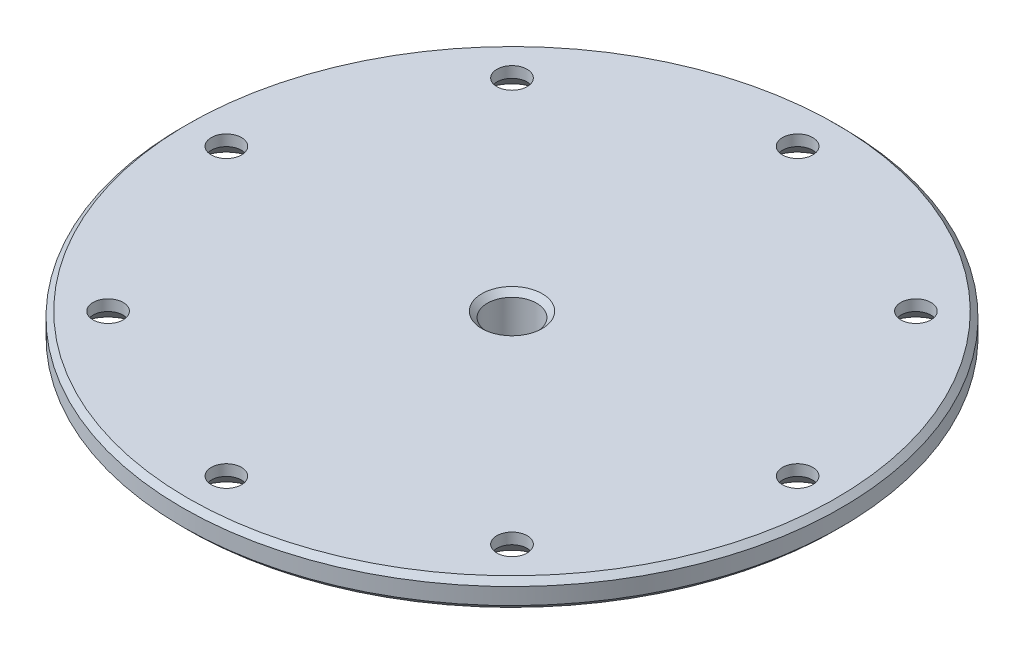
ISO-10303-21;
HEADER;
FILE_DESCRIPTION(('STEP AP214'),'2;1');
FILE_NAME('part.step','',(''),(''),'','','');
FILE_SCHEMA(('AUTOMOTIVE_DESIGN { 1 0 10303 214 1 1 1 1 }'));
ENDSEC;
DATA;
#1=APPLICATION_CONTEXT('core data for automotive mechanical design processes');
#2=APPLICATION_PROTOCOL_DEFINITION('international standard','automotive_design',2000,#1);
#3=PRODUCT_CONTEXT('',#1,'mechanical');
#4=PRODUCT('Part','Part','',(#3));
#5=PRODUCT_RELATED_PRODUCT_CATEGORY('part','',(#4));
#6=PRODUCT_DEFINITION_FORMATION('','',#4);
#7=PRODUCT_DEFINITION_CONTEXT('part definition',#1,'design');
#8=PRODUCT_DEFINITION('design','',#6,#7);
#9=PRODUCT_DEFINITION_SHAPE('','',#8);
#10=(LENGTH_UNIT() NAMED_UNIT(*) SI_UNIT(.MILLI.,.METRE.));
#11=(NAMED_UNIT(*) PLANE_ANGLE_UNIT() SI_UNIT($,.RADIAN.));
#12=(NAMED_UNIT(*) SI_UNIT($,.STERADIAN.) SOLID_ANGLE_UNIT());
#13=UNCERTAINTY_MEASURE_WITH_UNIT(LENGTH_MEASURE(1.E-05),#10,'distance_accuracy_value','');
#14=(GEOMETRIC_REPRESENTATION_CONTEXT(3) GLOBAL_UNCERTAINTY_ASSIGNED_CONTEXT((#13)) GLOBAL_UNIT_ASSIGNED_CONTEXT((#10,
#11,#12)) REPRESENTATION_CONTEXT('',''));
#15=CARTESIAN_POINT('',(0.,0.,0.));
#16=DIRECTION('',(0.,0.,1.));
#17=DIRECTION('',(1.,0.,0.));
#18=AXIS2_PLACEMENT_3D('',#15,#16,#17);
#19=CARTESIAN_POINT('',(0.,0.,0.));
#20=DIRECTION('',(0.,-1.,0.));
#21=DIRECTION('',(0.,0.,-1.));
#22=AXIS2_PLACEMENT_3D('',#19,#20,#21);
#23=PLANE('',#22);
#24=CARTESIAN_POINT('',(0.,0.,0.));
#25=DIRECTION('',(0.,-1.,0.));
#26=DIRECTION('',(0.,0.,-1.));
#27=AXIS2_PLACEMENT_3D('',#24,#25,#26);
#28=CIRCLE('',#27,5.49999999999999);
#29=CARTESIAN_POINT('',(0.,0.,-5.49999999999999));
#30=VERTEX_POINT('',#29);
#31=EDGE_CURVE('E35',#30,#30,#28,.F.);
#32=ORIENTED_EDGE('',*,*,#31,.T.);
#33=EDGE_LOOP('',(#32));
#34=FACE_BOUND('',#33,.T.);
#35=CARTESIAN_POINT('',(0.,0.,0.));
#36=DIRECTION('',(0.,-1.,0.));
#37=DIRECTION('',(0.,0.,-1.));
#38=AXIS2_PLACEMENT_3D('',#35,#36,#37);
#39=CIRCLE('',#38,14.);
#40=CARTESIAN_POINT('',(0.,0.,-14.));
#41=VERTEX_POINT('',#40);
#42=EDGE_CURVE('E117',#41,#41,#39,.T.);
#43=ORIENTED_EDGE('',*,*,#42,.T.);
#44=EDGE_LOOP('',(#43));
#45=FACE_BOUND('',#44,.T.);
#46=ADVANCED_FACE('F28',(#34,#45),#23,.T.);
#47=CARTESIAN_POINT('',(0.,0.,0.));
#48=DIRECTION('',(0.,-1.,0.));
#49=DIRECTION('',(0.,0.,-1.));
#50=AXIS2_PLACEMENT_3D('',#47,#48,#49);
#51=CYLINDRICAL_SURFACE('',#50,15.);
#52=CARTESIAN_POINT('',(0.,1.00000000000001,0.));
#53=DIRECTION('',(0.,-1.,0.));
#54=DIRECTION('',(0.,0.,-1.));
#55=AXIS2_PLACEMENT_3D('',#52,#53,#54);
#56=CIRCLE('',#55,15.);
#57=CARTESIAN_POINT('',(0.,1.00000000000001,-15.));
#58=VERTEX_POINT('',#57);
#59=EDGE_CURVE('E114',#58,#58,#56,.F.);
#60=ORIENTED_EDGE('',*,*,#59,.T.);
#61=EDGE_LOOP('',(#60));
#62=FACE_BOUND('',#61,.T.);
#63=CARTESIAN_POINT('',(0.,6.,0.));
#64=DIRECTION('',(0.,-1.,0.));
#65=DIRECTION('',(0.,0.,-1.));
#66=AXIS2_PLACEMENT_3D('',#63,#64,#65);
#67=CIRCLE('',#66,15.);
#68=CARTESIAN_POINT('',(0.,6.,-15.));
#69=VERTEX_POINT('',#68);
#70=EDGE_CURVE('E120',#69,#69,#67,.T.);
#71=ORIENTED_EDGE('',*,*,#70,.T.);
#72=EDGE_LOOP('',(#71));
#73=FACE_BOUND('',#72,.T.);
#74=ADVANCED_FACE('F195',(#62,#73),#51,.T.);
#75=CARTESIAN_POINT('',(15.,6.,0.));
#76=DIRECTION('',(0.,-1.,0.));
#77=DIRECTION('',(0.,0.,-1.));
#78=AXIS2_PLACEMENT_3D('',#75,#76,#77);
#79=PLANE('',#78);
#80=CARTESIAN_POINT('',(0.,6.,0.));
#81=DIRECTION('',(0.,-1.,0.));
#82=DIRECTION('',(0.,0.,-1.));
#83=AXIS2_PLACEMENT_3D('',#80,#81,#82);
#84=CIRCLE('',#83,21.);
#85=CARTESIAN_POINT('',(0.,6.,-21.));
#86=VERTEX_POINT('',#85);
#87=EDGE_CURVE('E111',#86,#86,#84,.T.);
#88=ORIENTED_EDGE('',*,*,#87,.T.);
#89=EDGE_LOOP('',(#88));
#90=FACE_BOUND('',#89,.T.);
#91=ORIENTED_EDGE('',*,*,#70,.F.);
#92=EDGE_LOOP('',(#91));
#93=FACE_BOUND('',#92,.T.);
#94=ADVANCED_FACE('F200',(#90,#93),#79,.T.);
#95=CARTESIAN_POINT('',(0.,0.,0.));
#96=DIRECTION('',(0.,-1.,0.));
#97=DIRECTION('',(0.,0.,-1.));
#98=AXIS2_PLACEMENT_3D('',#95,#96,#97);
#99=CYLINDRICAL_SURFACE('',#98,22.);
#100=CARTESIAN_POINT('',(0.,7.,0.));
#101=DIRECTION('',(0.,-1.,0.));
#102=DIRECTION('',(0.,0.,-1.));
#103=AXIS2_PLACEMENT_3D('',#100,#101,#102);
#104=CIRCLE('',#103,22.);
#105=CARTESIAN_POINT('',(0.,7.,-22.));
#106=VERTEX_POINT('',#105);
#107=EDGE_CURVE('E108',#106,#106,#104,.F.);
#108=ORIENTED_EDGE('',*,*,#107,.T.);
#109=EDGE_LOOP('',(#108));
#110=FACE_BOUND('',#109,.T.);
#111=CARTESIAN_POINT('',(0.,11.,0.));
#112=DIRECTION('',(0.,-1.,0.));
#113=DIRECTION('',(0.,0.,-1.));
#114=AXIS2_PLACEMENT_3D('',#111,#112,#113);
#115=CIRCLE('',#114,22.);
#116=CARTESIAN_POINT('',(0.,11.,-22.));
#117=VERTEX_POINT('',#116);
#118=EDGE_CURVE('E123',#117,#117,#115,.T.);
#119=ORIENTED_EDGE('',*,*,#118,.T.);
#120=EDGE_LOOP('',(#119));
#121=FACE_BOUND('',#120,.T.);
#122=ADVANCED_FACE('F191',(#110,#121),#99,.T.);
#123=CARTESIAN_POINT('',(22.,11.,0.));
#124=DIRECTION('',(0.,-1.,0.));
#125=DIRECTION('',(0.,0.,-1.));
#126=AXIS2_PLACEMENT_3D('',#123,#124,#125);
#127=PLANE('',#126);
#128=CARTESIAN_POINT('',(52.,11.,-5.44671088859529E-13));
#129=DIRECTION('',(0.,-1.,0.));
#130=DIRECTION('',(0.,0.,-1.));
#131=AXIS2_PLACEMENT_3D('',#128,#129,#130);
#132=CIRCLE('',#131,5.75000000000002);
#133=CARTESIAN_POINT('',(52.,11.,-5.75000000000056));
#134=VERTEX_POINT('',#133);
#135=EDGE_CURVE('E69',#134,#134,#132,.F.);
#136=ORIENTED_EDGE('',*,*,#135,.T.);
#137=EDGE_LOOP('',(#136));
#138=FACE_BOUND('',#137,.T.);
#139=CARTESIAN_POINT('',(36.7695526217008,11.,36.7695526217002));
#140=DIRECTION('',(0.,-1.,0.));
#141=DIRECTION('',(0.,0.,-1.));
#142=AXIS2_PLACEMENT_3D('',#139,#140,#141);
#143=CIRCLE('',#142,5.75000000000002);
#144=CARTESIAN_POINT('',(36.7695526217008,11.,31.0195526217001));
#145=VERTEX_POINT('',#144);
#146=EDGE_CURVE('E72',#145,#145,#143,.F.);
#147=ORIENTED_EDGE('',*,*,#146,.T.);
#148=EDGE_LOOP('',(#147));
#149=FACE_BOUND('',#148,.T.);
#150=CARTESIAN_POINT('',(0.,11.,52.));
#151=DIRECTION('',(0.,-1.,0.));
#152=DIRECTION('',(0.,0.,-1.));
#153=AXIS2_PLACEMENT_3D('',#150,#151,#152);
#154=CIRCLE('',#153,5.75000000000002);
#155=CARTESIAN_POINT('',(0.,11.,46.25));
#156=VERTEX_POINT('',#155);
#157=EDGE_CURVE('E75',#156,#156,#154,.F.);
#158=ORIENTED_EDGE('',*,*,#157,.T.);
#159=EDGE_LOOP('',(#158));
#160=FACE_BOUND('',#159,.T.);
#161=CARTESIAN_POINT('',(-36.7695526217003,11.,36.7695526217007));
#162=DIRECTION('',(0.,-1.,0.));
#163=DIRECTION('',(0.,0.,-1.));
#164=AXIS2_PLACEMENT_3D('',#161,#162,#163);
#165=CIRCLE('',#164,5.75000000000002);
#166=CARTESIAN_POINT('',(-36.7695526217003,11.,31.0195526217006));
#167=VERTEX_POINT('',#166);
#168=EDGE_CURVE('E78',#167,#167,#165,.F.);
#169=ORIENTED_EDGE('',*,*,#168,.T.);
#170=EDGE_LOOP('',(#169));
#171=FACE_BOUND('',#170,.T.);
#172=CARTESIAN_POINT('',(-52.,11.,1.81557029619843E-13));
#173=DIRECTION('',(0.,-1.,0.));
#174=DIRECTION('',(0.,0.,-1.));
#175=AXIS2_PLACEMENT_3D('',#172,#173,#174);
#176=CIRCLE('',#175,5.75000000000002);
#177=CARTESIAN_POINT('',(-52.,11.,-5.74999999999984));
#178=VERTEX_POINT('',#177);
#179=EDGE_CURVE('E81',#178,#178,#176,.F.);
#180=ORIENTED_EDGE('',*,*,#179,.T.);
#181=EDGE_LOOP('',(#180));
#182=FACE_BOUND('',#181,.T.);
#183=CARTESIAN_POINT('',(-36.7695526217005,11.,-36.7695526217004));
#184=DIRECTION('',(0.,-1.,0.));
#185=DIRECTION('',(0.,0.,-1.));
#186=AXIS2_PLACEMENT_3D('',#183,#184,#185);
#187=CIRCLE('',#186,5.75000000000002);
#188=CARTESIAN_POINT('',(-36.7695526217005,11.,-42.5195526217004));
#189=VERTEX_POINT('',#188);
#190=EDGE_CURVE('E84',#189,#189,#187,.F.);
#191=ORIENTED_EDGE('',*,*,#190,.T.);
#192=EDGE_LOOP('',(#191));
#193=FACE_BOUND('',#192,.T.);
#194=CARTESIAN_POINT('',(0.,11.,-52.));
#195=DIRECTION('',(0.,-1.,0.));
#196=DIRECTION('',(0.,0.,-1.));
#197=AXIS2_PLACEMENT_3D('',#194,#195,#196);
#198=CIRCLE('',#197,5.75000000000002);
#199=CARTESIAN_POINT('',(0.,11.,-57.75));
#200=VERTEX_POINT('',#199);
#201=EDGE_CURVE('E87',#200,#200,#198,.F.);
#202=ORIENTED_EDGE('',*,*,#201,.T.);
#203=EDGE_LOOP('',(#202));
#204=FACE_BOUND('',#203,.T.);
#205=CARTESIAN_POINT('',(36.7695526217,11.,-36.7695526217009));
#206=DIRECTION('',(0.,-1.,0.));
#207=DIRECTION('',(0.,0.,-1.));
#208=AXIS2_PLACEMENT_3D('',#205,#206,#207);
#209=CIRCLE('',#208,5.75000000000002);
#210=CARTESIAN_POINT('',(36.7695526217,11.,-42.5195526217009));
#211=VERTEX_POINT('',#210);
#212=EDGE_CURVE('E90',#211,#211,#209,.F.);
#213=ORIENTED_EDGE('',*,*,#212,.T.);
#214=EDGE_LOOP('',(#213));
#215=FACE_BOUND('',#214,.T.);
#216=CARTESIAN_POINT('',(0.,11.,0.));
#217=DIRECTION('',(0.,-1.,0.));
#218=DIRECTION('',(0.,0.,-1.));
#219=AXIS2_PLACEMENT_3D('',#216,#217,#218);
#220=CIRCLE('',#219,59.);
#221=CARTESIAN_POINT('',(0.,11.,-59.));
#222=VERTEX_POINT('',#221);
#223=EDGE_CURVE('E105',#222,#222,#220,.T.);
#224=ORIENTED_EDGE('',*,*,#223,.T.);
#225=EDGE_LOOP('',(#224));
#226=FACE_BOUND('',#225,.T.);
#227=ORIENTED_EDGE('',*,*,#118,.F.);
#228=EDGE_LOOP('',(#227));
#229=FACE_BOUND('',#228,.T.);
#230=ADVANCED_FACE('F185',(#138,#149,#160,#171,#182,#193,#204,#215,#226,#229),#127,.T.);
#231=CARTESIAN_POINT('',(0.,0.,0.));
#232=DIRECTION('',(0.,-1.,0.));
#233=DIRECTION('',(0.,0.,-1.));
#234=AXIS2_PLACEMENT_3D('',#231,#232,#233);
#235=CYLINDRICAL_SURFACE('',#234,60.);
#236=CARTESIAN_POINT('',(0.,12.,0.));
#237=DIRECTION('',(0.,-1.,0.));
#238=DIRECTION('',(0.,0.,-1.));
#239=AXIS2_PLACEMENT_3D('',#236,#237,#238);
#240=CIRCLE('',#239,60.);
#241=CARTESIAN_POINT('',(0.,12.,-60.));
#242=VERTEX_POINT('',#241);
#243=EDGE_CURVE('E99',#242,#242,#240,.F.);
#244=ORIENTED_EDGE('',*,*,#243,.T.);
#245=EDGE_LOOP('',(#244));
#246=FACE_BOUND('',#245,.T.);
#247=CARTESIAN_POINT('',(0.,15.,0.));
#248=DIRECTION('',(0.,1.,0.));
#249=DIRECTION('',(0.,0.,1.));
#250=AXIS2_PLACEMENT_3D('',#247,#248,#249);
#251=CIRCLE('',#250,60.);
#252=CARTESIAN_POINT('',(0.,15.,60.));
#253=VERTEX_POINT('',#252);
#254=EDGE_CURVE('E102',#253,#253,#251,.F.);
#255=ORIENTED_EDGE('',*,*,#254,.T.);
#256=EDGE_LOOP('',(#255));
#257=FACE_BOUND('',#256,.T.);
#258=ADVANCED_FACE('F157',(#246,#257),#235,.T.);
#259=CARTESIAN_POINT('',(60.,16.,0.));
#260=DIRECTION('',(0.,1.,0.));
#261=DIRECTION('',(0.,0.,1.));
#262=AXIS2_PLACEMENT_3D('',#259,#260,#261);
#263=PLANE('',#262);
#264=CARTESIAN_POINT('',(0.,16.,0.));
#265=DIRECTION('',(0.,1.,0.));
#266=DIRECTION('',(0.,0.,1.));
#267=AXIS2_PLACEMENT_3D('',#264,#265,#266);
#268=CIRCLE('',#267,5.49999999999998);
#269=CARTESIAN_POINT('',(0.,16.,5.49999999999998));
#270=VERTEX_POINT('',#269);
#271=EDGE_CURVE('E39',#270,#270,#268,.F.);
#272=ORIENTED_EDGE('',*,*,#271,.T.);
#273=EDGE_LOOP('',(#272));
#274=FACE_BOUND('',#273,.T.);
#275=CARTESIAN_POINT('',(36.7695526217,16.,-36.7695526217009));
#276=DIRECTION('',(0.,1.,0.));
#277=DIRECTION('',(-0.707106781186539,0.,0.707106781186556));
#278=AXIS2_PLACEMENT_3D('',#275,#276,#277);
#279=CIRCLE('',#278,2.75);
#280=CARTESIAN_POINT('',(34.825008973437,16.,-34.8250089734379));
#281=VERTEX_POINT('',#280);
#282=EDGE_CURVE('E147',#281,#281,#279,.T.);
#283=ORIENTED_EDGE('',*,*,#282,.F.);
#284=EDGE_LOOP('',(#283));
#285=FACE_BOUND('',#284,.T.);
#286=CARTESIAN_POINT('',(52.,16.,-5.44671088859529E-13));
#287=DIRECTION('',(0.,1.,0.));
#288=DIRECTION('',(-1.,0.,0.));
#289=AXIS2_PLACEMENT_3D('',#286,#287,#288);
#290=CIRCLE('',#289,2.75);
#291=CARTESIAN_POINT('',(49.25,16.,-5.15866367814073E-13));
#292=VERTEX_POINT('',#291);
#293=EDGE_CURVE('E144',#292,#292,#290,.T.);
#294=ORIENTED_EDGE('',*,*,#293,.F.);
#295=EDGE_LOOP('',(#294));
#296=FACE_BOUND('',#295,.T.);
#297=CARTESIAN_POINT('',(36.7695526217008,16.,36.7695526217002));
#298=DIRECTION('',(0.,1.,0.));
#299=DIRECTION('',(-0.707106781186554,0.,-0.707106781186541));
#300=AXIS2_PLACEMENT_3D('',#297,#298,#299);
#301=CIRCLE('',#300,2.75);
#302=CARTESIAN_POINT('',(34.8250089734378,16.,34.8250089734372));
#303=VERTEX_POINT('',#302);
#304=EDGE_CURVE('E141',#303,#303,#301,.T.);
#305=ORIENTED_EDGE('',*,*,#304,.F.);
#306=EDGE_LOOP('',(#305));
#307=FACE_BOUND('',#306,.T.);
#308=CARTESIAN_POINT('',(0.,16.,52.));
#309=DIRECTION('',(0.,1.,0.));
#310=DIRECTION('',(0.,0.,-1.));
#311=AXIS2_PLACEMENT_3D('',#308,#309,#310);
#312=CIRCLE('',#311,2.75);
#313=CARTESIAN_POINT('',(0.,16.,49.25));
#314=VERTEX_POINT('',#313);
#315=EDGE_CURVE('E138',#314,#314,#312,.T.);
#316=ORIENTED_EDGE('',*,*,#315,.F.);
#317=EDGE_LOOP('',(#316));
#318=FACE_BOUND('',#317,.T.);
#319=CARTESIAN_POINT('',(-36.7695526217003,16.,36.7695526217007));
#320=DIRECTION('',(0.,1.,0.));
#321=DIRECTION('',(0.707106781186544,0.,-0.707106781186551));
#322=AXIS2_PLACEMENT_3D('',#319,#320,#321);
#323=CIRCLE('',#322,2.75);
#324=CARTESIAN_POINT('',(-34.8250089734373,16.,34.8250089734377));
#325=VERTEX_POINT('',#324);
#326=EDGE_CURVE('E135',#325,#325,#323,.T.);
#327=ORIENTED_EDGE('',*,*,#326,.F.);
#328=EDGE_LOOP('',(#327));
#329=FACE_BOUND('',#328,.T.);
#330=CARTESIAN_POINT('',(-52.,16.,1.81557029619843E-13));
#331=DIRECTION('',(0.,1.,0.));
#332=DIRECTION('',(1.,0.,0.));
#333=AXIS2_PLACEMENT_3D('',#330,#331,#332);
#334=CIRCLE('',#333,2.75);
#335=CARTESIAN_POINT('',(-49.25,16.,1.71955455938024E-13));
#336=VERTEX_POINT('',#335);
#337=EDGE_CURVE('E132',#336,#336,#334,.T.);
#338=ORIENTED_EDGE('',*,*,#337,.F.);
#339=EDGE_LOOP('',(#338));
#340=FACE_BOUND('',#339,.T.);
#341=CARTESIAN_POINT('',(-36.7695526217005,16.,-36.7695526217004));
#342=DIRECTION('',(0.,1.,0.));
#343=DIRECTION('',(0.707106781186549,0.,0.707106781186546));
#344=AXIS2_PLACEMENT_3D('',#341,#342,#343);
#345=CIRCLE('',#344,2.75);
#346=CARTESIAN_POINT('',(-34.8250089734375,16.,-34.8250089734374));
#347=VERTEX_POINT('',#346);
#348=EDGE_CURVE('E129',#347,#347,#345,.T.);
#349=ORIENTED_EDGE('',*,*,#348,.F.);
#350=EDGE_LOOP('',(#349));
#351=FACE_BOUND('',#350,.T.);
#352=CARTESIAN_POINT('',(0.,16.,-52.));
#353=DIRECTION('',(0.,1.,0.));
#354=DIRECTION('',(0.,0.,1.));
#355=AXIS2_PLACEMENT_3D('',#352,#353,#354);
#356=CIRCLE('',#355,2.75);
#357=CARTESIAN_POINT('',(0.,16.,-49.25));
#358=VERTEX_POINT('',#357);
#359=EDGE_CURVE('E126',#358,#358,#356,.T.);
#360=ORIENTED_EDGE('',*,*,#359,.F.);
#361=EDGE_LOOP('',(#360));
#362=FACE_BOUND('',#361,.T.);
#363=CARTESIAN_POINT('',(0.,16.,0.));
#364=DIRECTION('',(0.,1.,0.));
#365=DIRECTION('',(0.,0.,1.));
#366=AXIS2_PLACEMENT_3D('',#363,#364,#365);
#367=CIRCLE('',#366,59.);
#368=CARTESIAN_POINT('',(0.,16.,59.));
#369=VERTEX_POINT('',#368);
#370=EDGE_CURVE('E96',#369,#369,#367,.T.);
#371=ORIENTED_EDGE('',*,*,#370,.T.);
#372=EDGE_LOOP('',(#371));
#373=FACE_BOUND('',#372,.T.);
#374=ADVANCED_FACE('F153',(#274,#285,#296,#307,#318,#329,#340,#351,#362,#373),#263,.T.);
#375=CARTESIAN_POINT('',(0.,0.,0.));
#376=DIRECTION('',(0.,1.,0.));
#377=DIRECTION('',(0.,0.,1.));
#378=AXIS2_PLACEMENT_3D('',#375,#376,#377);
#379=CONICAL_SURFACE('',#378,14.,0.785398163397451);
#380=ORIENTED_EDGE('',*,*,#59,.F.);
#381=EDGE_LOOP('',(#380));
#382=FACE_BOUND('',#381,.T.);
#383=ORIENTED_EDGE('',*,*,#42,.F.);
#384=EDGE_LOOP('',(#383));
#385=FACE_BOUND('',#384,.T.);
#386=ADVANCED_FACE('F156',(#382,#385),#379,.T.);
#387=CARTESIAN_POINT('',(0.,6.,0.));
#388=DIRECTION('',(0.,1.,0.));
#389=DIRECTION('',(0.,0.,1.));
#390=AXIS2_PLACEMENT_3D('',#387,#388,#389);
#391=CONICAL_SURFACE('',#390,21.,0.785398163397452);
#392=ORIENTED_EDGE('',*,*,#107,.F.);
#393=EDGE_LOOP('',(#392));
#394=FACE_BOUND('',#393,.T.);
#395=ORIENTED_EDGE('',*,*,#87,.F.);
#396=EDGE_LOOP('',(#395));
#397=FACE_BOUND('',#396,.T.);
#398=ADVANCED_FACE('F208',(#394,#397),#391,.T.);
#399=CARTESIAN_POINT('',(0.,11.,0.));
#400=DIRECTION('',(0.,1.,0.));
#401=DIRECTION('',(0.,0.,1.));
#402=AXIS2_PLACEMENT_3D('',#399,#400,#401);
#403=CONICAL_SURFACE('',#402,59.,0.785398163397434);
#404=ORIENTED_EDGE('',*,*,#243,.F.);
#405=EDGE_LOOP('',(#404));
#406=FACE_BOUND('',#405,.T.);
#407=ORIENTED_EDGE('',*,*,#223,.F.);
#408=EDGE_LOOP('',(#407));
#409=FACE_BOUND('',#408,.T.);
#410=ADVANCED_FACE('F180',(#406,#409),#403,.T.);
#411=CARTESIAN_POINT('',(0.,15.,0.));
#412=DIRECTION('',(0.,-1.,0.));
#413=DIRECTION('',(0.,0.,-1.));
#414=AXIS2_PLACEMENT_3D('',#411,#412,#413);
#415=CONICAL_SURFACE('',#414,60.,0.785398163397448);
#416=ORIENTED_EDGE('',*,*,#370,.F.);
#417=EDGE_LOOP('',(#416));
#418=FACE_BOUND('',#417,.T.);
#419=ORIENTED_EDGE('',*,*,#254,.F.);
#420=EDGE_LOOP('',(#419));
#421=FACE_BOUND('',#420,.T.);
#422=ADVANCED_FACE('F176',(#418,#421),#415,.T.);
#423=CARTESIAN_POINT('',(0.,0.,0.));
#424=DIRECTION('',(0.,1.,0.));
#425=DIRECTION('',(0.,0.,1.));
#426=AXIS2_PLACEMENT_3D('',#423,#424,#425);
#427=CYLINDRICAL_SURFACE('',#426,4.5);
#428=CARTESIAN_POINT('',(0.,1.,0.));
#429=DIRECTION('',(0.,-1.,0.));
#430=DIRECTION('',(0.,0.,-1.));
#431=AXIS2_PLACEMENT_3D('',#428,#429,#430);
#432=CIRCLE('',#431,4.5);
#433=CARTESIAN_POINT('',(0.,1.,-4.5));
#434=VERTEX_POINT('',#433);
#435=EDGE_CURVE('E10',#434,#434,#432,.T.);
#436=ORIENTED_EDGE('',*,*,#435,.T.);
#437=EDGE_LOOP('',(#436));
#438=FACE_BOUND('',#437,.T.);
#439=CARTESIAN_POINT('',(0.,15.,0.));
#440=DIRECTION('',(0.,1.,0.));
#441=DIRECTION('',(0.,0.,1.));
#442=AXIS2_PLACEMENT_3D('',#439,#440,#441);
#443=CIRCLE('',#442,4.5);
#444=CARTESIAN_POINT('',(0.,15.,4.5));
#445=VERTEX_POINT('',#444);
#446=EDGE_CURVE('E43',#445,#445,#443,.T.);
#447=ORIENTED_EDGE('',*,*,#446,.T.);
#448=EDGE_LOOP('',(#447));
#449=FACE_BOUND('',#448,.T.);
#450=ADVANCED_FACE('F179',(#438,#449),#427,.F.);
#451=CARTESIAN_POINT('',(0.,0.,-52.));
#452=DIRECTION('',(0.,1.,0.));
#453=DIRECTION('',(0.,0.,1.));
#454=AXIS2_PLACEMENT_3D('',#451,#452,#453);
#455=CYLINDRICAL_SURFACE('',#454,2.75);
#456=CARTESIAN_POINT('',(0.,14.,-52.));
#457=DIRECTION('',(0.,-1.,0.));
#458=DIRECTION('',(0.,0.,-1.));
#459=AXIS2_PLACEMENT_3D('',#456,#457,#458);
#460=CIRCLE('',#459,2.75);
#461=CARTESIAN_POINT('',(0.,14.,-54.75));
#462=VERTEX_POINT('',#461);
#463=EDGE_CURVE('E51',#462,#462,#460,.T.);
#464=ORIENTED_EDGE('',*,*,#463,.T.);
#465=EDGE_LOOP('',(#464));
#466=FACE_BOUND('',#465,.T.);
#467=ORIENTED_EDGE('',*,*,#359,.T.);
#468=EDGE_LOOP('',(#467));
#469=FACE_BOUND('',#468,.T.);
#470=ADVANCED_FACE('F259',(#466,#469),#455,.F.);
#471=CARTESIAN_POINT('',(-36.7695526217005,0.,-36.7695526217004));
#472=DIRECTION('',(0.,1.,0.));
#473=DIRECTION('',(0.,0.,1.));
#474=AXIS2_PLACEMENT_3D('',#471,#472,#473);
#475=CYLINDRICAL_SURFACE('',#474,2.75);
#476=CARTESIAN_POINT('',(-36.7695526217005,14.,-36.7695526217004));
#477=DIRECTION('',(0.,-1.,0.));
#478=DIRECTION('',(0.,0.,-1.));
#479=AXIS2_PLACEMENT_3D('',#476,#477,#478);
#480=CIRCLE('',#479,2.75);
#481=CARTESIAN_POINT('',(-36.7695526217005,14.,-39.5195526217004));
#482=VERTEX_POINT('',#481);
#483=EDGE_CURVE('E54',#482,#482,#480,.T.);
#484=ORIENTED_EDGE('',*,*,#483,.T.);
#485=EDGE_LOOP('',(#484));
#486=FACE_BOUND('',#485,.T.);
#487=ORIENTED_EDGE('',*,*,#348,.T.);
#488=EDGE_LOOP('',(#487));
#489=FACE_BOUND('',#488,.T.);
#490=ADVANCED_FACE('F264',(#486,#489),#475,.F.);
#491=CARTESIAN_POINT('',(-52.,0.,1.81557029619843E-13));
#492=DIRECTION('',(0.,1.,0.));
#493=DIRECTION('',(0.,0.,1.));
#494=AXIS2_PLACEMENT_3D('',#491,#492,#493);
#495=CYLINDRICAL_SURFACE('',#494,2.75);
#496=CARTESIAN_POINT('',(-52.,14.,1.81557029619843E-13));
#497=DIRECTION('',(0.,-1.,0.));
#498=DIRECTION('',(0.,0.,-1.));
#499=AXIS2_PLACEMENT_3D('',#496,#497,#498);
#500=CIRCLE('',#499,2.75);
#501=CARTESIAN_POINT('',(-52.,14.,-2.74999999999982));
#502=VERTEX_POINT('',#501);
#503=EDGE_CURVE('E57',#502,#502,#500,.T.);
#504=ORIENTED_EDGE('',*,*,#503,.T.);
#505=EDGE_LOOP('',(#504));
#506=FACE_BOUND('',#505,.T.);
#507=ORIENTED_EDGE('',*,*,#337,.T.);
#508=EDGE_LOOP('',(#507));
#509=FACE_BOUND('',#508,.T.);
#510=ADVANCED_FACE('F270',(#506,#509),#495,.F.);
#511=CARTESIAN_POINT('',(-36.7695526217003,0.,36.7695526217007));
#512=DIRECTION('',(0.,1.,0.));
#513=DIRECTION('',(0.,0.,1.));
#514=AXIS2_PLACEMENT_3D('',#511,#512,#513);
#515=CYLINDRICAL_SURFACE('',#514,2.75);
#516=CARTESIAN_POINT('',(-36.7695526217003,14.,36.7695526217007));
#517=DIRECTION('',(0.,-1.,0.));
#518=DIRECTION('',(0.,0.,-1.));
#519=AXIS2_PLACEMENT_3D('',#516,#517,#518);
#520=CIRCLE('',#519,2.75);
#521=CARTESIAN_POINT('',(-36.7695526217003,14.,34.0195526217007));
#522=VERTEX_POINT('',#521);
#523=EDGE_CURVE('E60',#522,#522,#520,.T.);
#524=ORIENTED_EDGE('',*,*,#523,.T.);
#525=EDGE_LOOP('',(#524));
#526=FACE_BOUND('',#525,.T.);
#527=ORIENTED_EDGE('',*,*,#326,.T.);
#528=EDGE_LOOP('',(#527));
#529=FACE_BOUND('',#528,.T.);
#530=ADVANCED_FACE('F274',(#526,#529),#515,.F.);
#531=CARTESIAN_POINT('',(0.,0.,52.));
#532=DIRECTION('',(0.,1.,0.));
#533=DIRECTION('',(0.,0.,1.));
#534=AXIS2_PLACEMENT_3D('',#531,#532,#533);
#535=CYLINDRICAL_SURFACE('',#534,2.75);
#536=CARTESIAN_POINT('',(0.,14.,52.));
#537=DIRECTION('',(0.,-1.,0.));
#538=DIRECTION('',(0.,0.,-1.));
#539=AXIS2_PLACEMENT_3D('',#536,#537,#538);
#540=CIRCLE('',#539,2.75);
#541=CARTESIAN_POINT('',(0.,14.,49.25));
#542=VERTEX_POINT('',#541);
#543=EDGE_CURVE('E63',#542,#542,#540,.T.);
#544=ORIENTED_EDGE('',*,*,#543,.T.);
#545=EDGE_LOOP('',(#544));
#546=FACE_BOUND('',#545,.T.);
#547=ORIENTED_EDGE('',*,*,#315,.T.);
#548=EDGE_LOOP('',(#547));
#549=FACE_BOUND('',#548,.T.);
#550=ADVANCED_FACE('F278',(#546,#549),#535,.F.);
#551=CARTESIAN_POINT('',(36.7695526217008,0.,36.7695526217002));
#552=DIRECTION('',(0.,1.,0.));
#553=DIRECTION('',(0.,0.,1.));
#554=AXIS2_PLACEMENT_3D('',#551,#552,#553);
#555=CYLINDRICAL_SURFACE('',#554,2.75);
#556=CARTESIAN_POINT('',(36.7695526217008,14.,36.7695526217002));
#557=DIRECTION('',(0.,-1.,0.));
#558=DIRECTION('',(0.,0.,-1.));
#559=AXIS2_PLACEMENT_3D('',#556,#557,#558);
#560=CIRCLE('',#559,2.75);
#561=CARTESIAN_POINT('',(36.7695526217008,14.,34.0195526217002));
#562=VERTEX_POINT('',#561);
#563=EDGE_CURVE('E66',#562,#562,#560,.T.);
#564=ORIENTED_EDGE('',*,*,#563,.T.);
#565=EDGE_LOOP('',(#564));
#566=FACE_BOUND('',#565,.T.);
#567=ORIENTED_EDGE('',*,*,#304,.T.);
#568=EDGE_LOOP('',(#567));
#569=FACE_BOUND('',#568,.T.);
#570=ADVANCED_FACE('F282',(#566,#569),#555,.F.);
#571=CARTESIAN_POINT('',(52.,0.,-5.44671088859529E-13));
#572=DIRECTION('',(0.,1.,0.));
#573=DIRECTION('',(0.,0.,1.));
#574=AXIS2_PLACEMENT_3D('',#571,#572,#573);
#575=CYLINDRICAL_SURFACE('',#574,2.75);
#576=CARTESIAN_POINT('',(52.,14.,-5.44671088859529E-13));
#577=DIRECTION('',(0.,-1.,0.));
#578=DIRECTION('',(0.,0.,-1.));
#579=AXIS2_PLACEMENT_3D('',#576,#577,#578);
#580=CIRCLE('',#579,2.75);
#581=CARTESIAN_POINT('',(52.,14.,-2.75000000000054));
#582=VERTEX_POINT('',#581);
#583=EDGE_CURVE('E93',#582,#582,#580,.T.);
#584=ORIENTED_EDGE('',*,*,#583,.T.);
#585=EDGE_LOOP('',(#584));
#586=FACE_BOUND('',#585,.T.);
#587=ORIENTED_EDGE('',*,*,#293,.T.);
#588=EDGE_LOOP('',(#587));
#589=FACE_BOUND('',#588,.T.);
#590=ADVANCED_FACE('F286',(#586,#589),#575,.F.);
#591=CARTESIAN_POINT('',(36.7695526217,0.,-36.7695526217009));
#592=DIRECTION('',(0.,1.,0.));
#593=DIRECTION('',(0.,0.,1.));
#594=AXIS2_PLACEMENT_3D('',#591,#592,#593);
#595=CYLINDRICAL_SURFACE('',#594,2.75);
#596=CARTESIAN_POINT('',(36.7695526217,14.,-36.7695526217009));
#597=DIRECTION('',(0.,-1.,0.));
#598=DIRECTION('',(0.,0.,-1.));
#599=AXIS2_PLACEMENT_3D('',#596,#597,#598);
#600=CIRCLE('',#599,2.75);
#601=CARTESIAN_POINT('',(36.7695526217,14.,-39.5195526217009));
#602=VERTEX_POINT('',#601);
#603=EDGE_CURVE('E48',#602,#602,#600,.T.);
#604=ORIENTED_EDGE('',*,*,#603,.T.);
#605=EDGE_LOOP('',(#604));
#606=FACE_BOUND('',#605,.T.);
#607=ORIENTED_EDGE('',*,*,#282,.T.);
#608=EDGE_LOOP('',(#607));
#609=FACE_BOUND('',#608,.T.);
#610=ADVANCED_FACE('F151',(#606,#609),#595,.F.);
#611=CARTESIAN_POINT('',(52.,14.,-5.44671088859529E-13));
#612=DIRECTION('',(0.,-1.,0.));
#613=DIRECTION('',(0.,0.,-1.));
#614=AXIS2_PLACEMENT_3D('',#611,#612,#613);
#615=CONICAL_SURFACE('',#614,2.75,0.785398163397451);
#616=ORIENTED_EDGE('',*,*,#135,.F.);
#617=EDGE_LOOP('',(#616));
#618=FACE_BOUND('',#617,.T.);
#619=ORIENTED_EDGE('',*,*,#583,.F.);
#620=EDGE_LOOP('',(#619));
#621=FACE_BOUND('',#620,.T.);
#622=ADVANCED_FACE('F216',(#618,#621),#615,.F.);
#623=CARTESIAN_POINT('',(36.7695526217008,14.,36.7695526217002));
#624=DIRECTION('',(0.,-1.,0.));
#625=DIRECTION('',(0.,0.,-1.));
#626=AXIS2_PLACEMENT_3D('',#623,#624,#625);
#627=CONICAL_SURFACE('',#626,2.75,0.785398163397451);
#628=ORIENTED_EDGE('',*,*,#146,.F.);
#629=EDGE_LOOP('',(#628));
#630=FACE_BOUND('',#629,.T.);
#631=ORIENTED_EDGE('',*,*,#563,.F.);
#632=EDGE_LOOP('',(#631));
#633=FACE_BOUND('',#632,.T.);
#634=ADVANCED_FACE('F219',(#630,#633),#627,.F.);
#635=CARTESIAN_POINT('',(0.,14.,52.));
#636=DIRECTION('',(0.,-1.,0.));
#637=DIRECTION('',(0.,0.,-1.));
#638=AXIS2_PLACEMENT_3D('',#635,#636,#637);
#639=CONICAL_SURFACE('',#638,2.75,0.785398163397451);
#640=ORIENTED_EDGE('',*,*,#157,.F.);
#641=EDGE_LOOP('',(#640));
#642=FACE_BOUND('',#641,.T.);
#643=ORIENTED_EDGE('',*,*,#543,.F.);
#644=EDGE_LOOP('',(#643));
#645=FACE_BOUND('',#644,.T.);
#646=ADVANCED_FACE('F223',(#642,#645),#639,.F.);
#647=CARTESIAN_POINT('',(-36.7695526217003,14.,36.7695526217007));
#648=DIRECTION('',(0.,-1.,0.));
#649=DIRECTION('',(0.,0.,-1.));
#650=AXIS2_PLACEMENT_3D('',#647,#648,#649);
#651=CONICAL_SURFACE('',#650,2.75,0.785398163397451);
#652=ORIENTED_EDGE('',*,*,#168,.F.);
#653=EDGE_LOOP('',(#652));
#654=FACE_BOUND('',#653,.T.);
#655=ORIENTED_EDGE('',*,*,#523,.F.);
#656=EDGE_LOOP('',(#655));
#657=FACE_BOUND('',#656,.T.);
#658=ADVANCED_FACE('F227',(#654,#657),#651,.F.);
#659=CARTESIAN_POINT('',(-52.,14.,1.81557029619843E-13));
#660=DIRECTION('',(0.,-1.,0.));
#661=DIRECTION('',(0.,0.,-1.));
#662=AXIS2_PLACEMENT_3D('',#659,#660,#661);
#663=CONICAL_SURFACE('',#662,2.75,0.785398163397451);
#664=ORIENTED_EDGE('',*,*,#179,.F.);
#665=EDGE_LOOP('',(#664));
#666=FACE_BOUND('',#665,.T.);
#667=ORIENTED_EDGE('',*,*,#503,.F.);
#668=EDGE_LOOP('',(#667));
#669=FACE_BOUND('',#668,.T.);
#670=ADVANCED_FACE('F231',(#666,#669),#663,.F.);
#671=CARTESIAN_POINT('',(-36.7695526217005,14.,-36.7695526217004));
#672=DIRECTION('',(0.,-1.,0.));
#673=DIRECTION('',(0.,0.,-1.));
#674=AXIS2_PLACEMENT_3D('',#671,#672,#673);
#675=CONICAL_SURFACE('',#674,2.75,0.785398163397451);
#676=ORIENTED_EDGE('',*,*,#190,.F.);
#677=EDGE_LOOP('',(#676));
#678=FACE_BOUND('',#677,.T.);
#679=ORIENTED_EDGE('',*,*,#483,.F.);
#680=EDGE_LOOP('',(#679));
#681=FACE_BOUND('',#680,.T.);
#682=ADVANCED_FACE('F235',(#678,#681),#675,.F.);
#683=CARTESIAN_POINT('',(0.,14.,-52.));
#684=DIRECTION('',(0.,-1.,0.));
#685=DIRECTION('',(0.,0.,-1.));
#686=AXIS2_PLACEMENT_3D('',#683,#684,#685);
#687=CONICAL_SURFACE('',#686,2.75,0.785398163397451);
#688=ORIENTED_EDGE('',*,*,#201,.F.);
#689=EDGE_LOOP('',(#688));
#690=FACE_BOUND('',#689,.T.);
#691=ORIENTED_EDGE('',*,*,#463,.F.);
#692=EDGE_LOOP('',(#691));
#693=FACE_BOUND('',#692,.T.);
#694=ADVANCED_FACE('F239',(#690,#693),#687,.F.);
#695=CARTESIAN_POINT('',(36.7695526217,14.,-36.7695526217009));
#696=DIRECTION('',(0.,-1.,0.));
#697=DIRECTION('',(0.,0.,-1.));
#698=AXIS2_PLACEMENT_3D('',#695,#696,#697);
#699=CONICAL_SURFACE('',#698,2.75,0.785398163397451);
#700=ORIENTED_EDGE('',*,*,#212,.F.);
#701=EDGE_LOOP('',(#700));
#702=FACE_BOUND('',#701,.T.);
#703=ORIENTED_EDGE('',*,*,#603,.F.);
#704=EDGE_LOOP('',(#703));
#705=FACE_BOUND('',#704,.T.);
#706=ADVANCED_FACE('F243',(#702,#705),#699,.F.);
#707=CARTESIAN_POINT('',(0.,15.,0.));
#708=DIRECTION('',(0.,1.,0.));
#709=DIRECTION('',(0.,0.,1.));
#710=AXIS2_PLACEMENT_3D('',#707,#708,#709);
#711=CONICAL_SURFACE('',#710,4.5,0.78539816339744);
#712=ORIENTED_EDGE('',*,*,#271,.F.);
#713=EDGE_LOOP('',(#712));
#714=FACE_BOUND('',#713,.T.);
#715=ORIENTED_EDGE('',*,*,#446,.F.);
#716=EDGE_LOOP('',(#715));
#717=FACE_BOUND('',#716,.T.);
#718=ADVANCED_FACE('F246',(#714,#717),#711,.F.);
#719=CARTESIAN_POINT('',(0.,0.,0.));
#720=DIRECTION('',(0.,-1.,0.));
#721=DIRECTION('',(0.,0.,-1.));
#722=AXIS2_PLACEMENT_3D('',#719,#720,#721);
#723=CONICAL_SURFACE('',#722,5.49999999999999,0.785398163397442);
#724=ORIENTED_EDGE('',*,*,#435,.F.);
#725=EDGE_LOOP('',(#724));
#726=FACE_BOUND('',#725,.T.);
#727=ORIENTED_EDGE('',*,*,#31,.F.);
#728=EDGE_LOOP('',(#727));
#729=FACE_BOUND('',#728,.T.);
#730=ADVANCED_FACE('F30',(#726,#729),#723,.F.);
#731=CLOSED_SHELL('',(#46,#74,#94,#122,#230,#258,#374,#386,#398,#410,#422,#450,#470,#490,#510,
#530,#550,#570,#590,#610,#622,#634,#646,#658,#670,#682,#694,#706,#718,#730));
#732=MANIFOLD_SOLID_BREP('B2',#731);
#733=ADVANCED_BREP_SHAPE_REPRESENTATION('',(#18,#732),#14);
#734=SHAPE_DEFINITION_REPRESENTATION(#9,#733);
ENDSEC;
END-ISO-10303-21;
